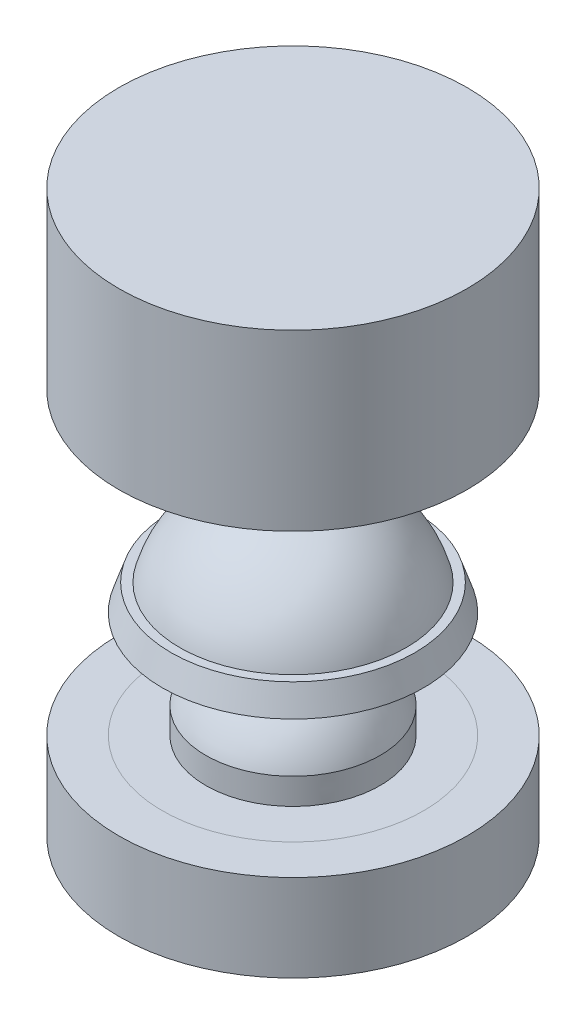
ISO-10303-21;
HEADER;
FILE_DESCRIPTION(('STEP AP214'),'2;1');
FILE_NAME('part.step','',(''),(''),'','','');
FILE_SCHEMA(('AUTOMOTIVE_DESIGN { 1 0 10303 214 1 1 1 1 }'));
ENDSEC;
DATA;
#1=APPLICATION_CONTEXT('core data for automotive mechanical design processes');
#2=APPLICATION_PROTOCOL_DEFINITION('international standard','automotive_design',2000,#1);
#3=PRODUCT_CONTEXT('',#1,'mechanical');
#4=PRODUCT('Part','Part','',(#3));
#5=PRODUCT_RELATED_PRODUCT_CATEGORY('part','',(#4));
#6=PRODUCT_DEFINITION_FORMATION('','',#4);
#7=PRODUCT_DEFINITION_CONTEXT('part definition',#1,'design');
#8=PRODUCT_DEFINITION('design','',#6,#7);
#9=PRODUCT_DEFINITION_SHAPE('','',#8);
#10=(LENGTH_UNIT() NAMED_UNIT(*) SI_UNIT(.MILLI.,.METRE.));
#11=(NAMED_UNIT(*) PLANE_ANGLE_UNIT() SI_UNIT($,.RADIAN.));
#12=(NAMED_UNIT(*) SI_UNIT($,.STERADIAN.) SOLID_ANGLE_UNIT());
#13=UNCERTAINTY_MEASURE_WITH_UNIT(LENGTH_MEASURE(1.E-05),#10,'distance_accuracy_value','');
#14=(GEOMETRIC_REPRESENTATION_CONTEXT(3) GLOBAL_UNCERTAINTY_ASSIGNED_CONTEXT((#13)) GLOBAL_UNIT_ASSIGNED_CONTEXT((#10,
#11,#12)) REPRESENTATION_CONTEXT('',''));
#15=CARTESIAN_POINT('',(0.,0.,0.));
#16=DIRECTION('',(0.,0.,1.));
#17=DIRECTION('',(1.,0.,0.));
#18=AXIS2_PLACEMENT_3D('',#15,#16,#17);
#19=CARTESIAN_POINT('',(14.8278025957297,-22.208846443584,0.));
#20=DIRECTION('',(0.,-1.,0.));
#21=DIRECTION('',(0.,0.,-1.));
#22=AXIS2_PLACEMENT_3D('',#19,#20,#21);
#23=PLANE('',#22);
#24=CARTESIAN_POINT('',(4.8278025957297,-22.208846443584,0.));
#25=DIRECTION('',(0.,-1.,0.));
#26=DIRECTION('',(0.,0.,-1.));
#27=AXIS2_PLACEMENT_3D('',#24,#25,#26);
#28=CIRCLE('',#27,15.);
#29=CARTESIAN_POINT('',(4.8278025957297,-22.208846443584,-15.));
#30=VERTEX_POINT('',#29);
#31=EDGE_CURVE('E90',#30,#30,#28,.T.);
#32=ORIENTED_EDGE('',*,*,#31,.T.);
#33=EDGE_LOOP('',(#32));
#34=FACE_BOUND('',#33,.T.);
#35=CARTESIAN_POINT('',(4.8278025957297,-22.208846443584,0.));
#36=DIRECTION('',(0.,-1.,0.));
#37=DIRECTION('',(0.,0.,-1.));
#38=AXIS2_PLACEMENT_3D('',#35,#36,#37);
#39=CIRCLE('',#38,10.);
#40=CARTESIAN_POINT('',(4.8278025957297,-22.208846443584,-10.));
#41=VERTEX_POINT('',#40);
#42=EDGE_CURVE('E12',#41,#41,#39,.T.);
#43=ORIENTED_EDGE('',*,*,#42,.F.);
#44=EDGE_LOOP('',(#43));
#45=FACE_BOUND('',#44,.T.);
#46=ADVANCED_FACE('F71',(#34,#45),#23,.T.);
#47=CARTESIAN_POINT('',(4.8278025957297,-19.208846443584,0.));
#48=DIRECTION('',(0.,1.,0.));
#49=DIRECTION('',(0.,0.,1.));
#50=AXIS2_PLACEMENT_3D('',#47,#48,#49);
#51=CONICAL_SURFACE('',#50,10.0016948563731,0.000564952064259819);
#52=ORIENTED_EDGE('',*,*,#42,.T.);
#53=EDGE_LOOP('',(#52));
#54=FACE_BOUND('',#53,.T.);
#55=CARTESIAN_POINT('',(4.8278025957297,-19.208846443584,0.));
#56=DIRECTION('',(0.,-1.,0.));
#57=DIRECTION('',(0.,0.,-1.));
#58=AXIS2_PLACEMENT_3D('',#55,#56,#57);
#59=CIRCLE('',#58,10.0016948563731);
#60=CARTESIAN_POINT('',(4.8278025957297,-19.208846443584,-10.0016948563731));
#61=VERTEX_POINT('',#60);
#62=EDGE_CURVE('E77',#61,#61,#59,.T.);
#63=ORIENTED_EDGE('',*,*,#62,.F.);
#64=EDGE_LOOP('',(#63));
#65=FACE_BOUND('',#64,.T.);
#66=ADVANCED_FACE('F110',(#54,#65),#51,.F.);
#67=CARTESIAN_POINT('',(4.8278025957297,-22.658846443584,0.));
#68=DIRECTION('',(0.,-1.,0.));
#69=DIRECTION('',(-1.,0.,0.));
#70=AXIS2_PLACEMENT_3D('',#67,#68,#69);
#71=SPHERICAL_SURFACE('',#70,10.58);
#72=ORIENTED_EDGE('',*,*,#62,.T.);
#73=EDGE_LOOP('',(#72));
#74=FACE_BOUND('',#73,.T.);
#75=ADVANCED_FACE('F113',(#74),#71,.F.);
#76=CARTESIAN_POINT('',(4.8278025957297,-22.658846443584,0.));
#77=DIRECTION('',(0.,-1.,0.));
#78=DIRECTION('',(1.,0.,0.));
#79=AXIS2_PLACEMENT_3D('',#76,#77,#78);
#80=SPHERICAL_SURFACE('',#79,13.45);
#81=CARTESIAN_POINT('',(4.8278025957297,-19.208846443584,0.));
#82=DIRECTION('',(0.,-1.,0.));
#83=DIRECTION('',(0.,0.,-1.));
#84=AXIS2_PLACEMENT_3D('',#81,#82,#83);
#85=CIRCLE('',#84,13.);
#86=CARTESIAN_POINT('',(4.8278025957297,-19.208846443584,-13.));
#87=VERTEX_POINT('',#86);
#88=EDGE_CURVE('E81',#87,#87,#85,.T.);
#89=ORIENTED_EDGE('',*,*,#88,.F.);
#90=EDGE_LOOP('',(#89));
#91=FACE_BOUND('',#90,.T.);
#92=ADVANCED_FACE('F106',(#91),#80,.T.);
#93=CARTESIAN_POINT('',(18.8278025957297,-19.208846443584,0.));
#94=DIRECTION('',(0.,1.,0.));
#95=DIRECTION('',(0.,0.,1.));
#96=AXIS2_PLACEMENT_3D('',#93,#94,#95);
#97=PLANE('',#96);
#98=ORIENTED_EDGE('',*,*,#88,.T.);
#99=EDGE_LOOP('',(#98));
#100=FACE_BOUND('',#99,.T.);
#101=CARTESIAN_POINT('',(4.8278025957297,-19.208846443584,0.));
#102=DIRECTION('',(0.,-1.,0.));
#103=DIRECTION('',(0.,0.,-1.));
#104=AXIS2_PLACEMENT_3D('',#101,#102,#103);
#105=CIRCLE('',#104,14.);
#106=CARTESIAN_POINT('',(4.8278025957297,-19.208846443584,-14.));
#107=VERTEX_POINT('',#106);
#108=EDGE_CURVE('E85',#107,#107,#105,.T.);
#109=ORIENTED_EDGE('',*,*,#108,.F.);
#110=EDGE_LOOP('',(#109));
#111=FACE_BOUND('',#110,.T.);
#112=ADVANCED_FACE('F101',(#100,#111),#97,.T.);
#113=CARTESIAN_POINT('',(4.8278025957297,-22.208846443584,0.));
#114=DIRECTION('',(0.,-1.,0.));
#115=DIRECTION('',(0.,0.,-1.));
#116=AXIS2_PLACEMENT_3D('',#113,#114,#115);
#117=CONICAL_SURFACE('',#116,15.,0.321750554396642);
#118=ORIENTED_EDGE('',*,*,#108,.T.);
#119=EDGE_LOOP('',(#118));
#120=FACE_BOUND('',#119,.T.);
#121=ORIENTED_EDGE('',*,*,#31,.F.);
#122=EDGE_LOOP('',(#121));
#123=FACE_BOUND('',#122,.T.);
#124=ADVANCED_FACE('F99',(#120,#123),#117,.T.);
#125=CLOSED_SHELL('',(#46,#66,#75,#92,#112,#124));
#126=MANIFOLD_SOLID_BREP('B2',#125);
#127=CARTESIAN_POINT('',(4.8278025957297,-44.4320712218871,0.));
#128=DIRECTION('',(0.,1.,0.));
#129=DIRECTION('',(0.,0.,1.));
#130=AXIS2_PLACEMENT_3D('',#127,#128,#129);
#131=PLANE('',#130);
#132=CARTESIAN_POINT('',(4.8278025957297,-44.4320712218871,0.));
#133=DIRECTION('',(0.,1.,0.));
#134=DIRECTION('',(0.,0.,1.));
#135=AXIS2_PLACEMENT_3D('',#132,#133,#134);
#136=CIRCLE('',#135,20.);
#137=CARTESIAN_POINT('',(4.8278025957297,-44.4320712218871,20.));
#138=VERTEX_POINT('',#137);
#139=EDGE_CURVE('E232',#138,#138,#136,.T.);
#140=ORIENTED_EDGE('',*,*,#139,.F.);
#141=EDGE_LOOP('',(#140));
#142=FACE_BOUND('',#141,.T.);
#143=ADVANCED_FACE('F198',(#142),#131,.F.);
#144=CARTESIAN_POINT('',(4.8278025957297,-44.4320712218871,0.));
#145=DIRECTION('',(0.,1.,0.));
#146=DIRECTION('',(0.,0.,1.));
#147=AXIS2_PLACEMENT_3D('',#144,#145,#146);
#148=CYLINDRICAL_SURFACE('',#147,20.);
#149=ORIENTED_EDGE('',*,*,#139,.T.);
#150=EDGE_LOOP('',(#149));
#151=FACE_BOUND('',#150,.T.);
#152=CARTESIAN_POINT('',(4.8278025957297,-34.4320712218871,0.));
#153=DIRECTION('',(0.,1.,0.));
#154=DIRECTION('',(0.,0.,1.));
#155=AXIS2_PLACEMENT_3D('',#152,#153,#154);
#156=CIRCLE('',#155,20.);
#157=CARTESIAN_POINT('',(4.8278025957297,-34.4320712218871,20.));
#158=VERTEX_POINT('',#157);
#159=EDGE_CURVE('E202',#158,#158,#156,.F.);
#160=ORIENTED_EDGE('',*,*,#159,.T.);
#161=EDGE_LOOP('',(#160));
#162=FACE_BOUND('',#161,.T.);
#163=ADVANCED_FACE('F200',(#151,#162),#148,.T.);
#164=CARTESIAN_POINT('',(4.8278025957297,-34.8820712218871,0.));
#165=DIRECTION('',(0.,-1.,0.));
#166=DIRECTION('',(-1.,0.,0.));
#167=AXIS2_PLACEMENT_3D('',#164,#165,#166);
#168=SPHERICAL_SURFACE('',#167,10.58);
#169=CARTESIAN_POINT('',(4.8278025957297,-31.4320712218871,0.));
#170=DIRECTION('',(0.,-1.,0.));
#171=DIRECTION('',(0.,0.,-1.));
#172=AXIS2_PLACEMENT_3D('',#169,#170,#171);
#173=CIRCLE('',#172,10.0016948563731);
#174=CARTESIAN_POINT('',(4.8278025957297,-31.4320712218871,-10.0016948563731));
#175=VERTEX_POINT('',#174);
#176=EDGE_CURVE('E234',#175,#175,#173,.T.);
#177=ORIENTED_EDGE('',*,*,#176,.F.);
#178=EDGE_LOOP('',(#177));
#179=FACE_BOUND('',#178,.T.);
#180=ADVANCED_FACE('F228',(#179),#168,.T.);
#181=CARTESIAN_POINT('',(4.8278025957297,-31.4320712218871,0.));
#182=DIRECTION('',(0.,1.,0.));
#183=DIRECTION('',(0.,0.,1.));
#184=AXIS2_PLACEMENT_3D('',#181,#182,#183);
#185=CONICAL_SURFACE('',#184,10.0016948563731,0.000564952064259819);
#186=CARTESIAN_POINT('',(4.8278025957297,-34.4320712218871,0.));
#187=DIRECTION('',(0.,-1.,0.));
#188=DIRECTION('',(0.,0.,-1.));
#189=AXIS2_PLACEMENT_3D('',#186,#187,#188);
#190=CIRCLE('',#189,10.);
#191=CARTESIAN_POINT('',(4.8278025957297,-34.4320712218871,-10.));
#192=VERTEX_POINT('',#191);
#193=EDGE_CURVE('E207',#192,#192,#190,.T.);
#194=ORIENTED_EDGE('',*,*,#193,.F.);
#195=EDGE_LOOP('',(#194));
#196=FACE_BOUND('',#195,.T.);
#197=ORIENTED_EDGE('',*,*,#176,.T.);
#198=EDGE_LOOP('',(#197));
#199=FACE_BOUND('',#198,.T.);
#200=ADVANCED_FACE('F220',(#196,#199),#185,.T.);
#201=CARTESIAN_POINT('',(14.8278025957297,-34.4320712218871,0.));
#202=DIRECTION('',(0.,-1.,0.));
#203=DIRECTION('',(0.,0.,-1.));
#204=AXIS2_PLACEMENT_3D('',#201,#202,#203);
#205=PLANE('',#204);
#206=CARTESIAN_POINT('',(4.8278025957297,-34.4320712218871,-15.));
#207=CARTESIAN_POINT('',(5.07532465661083,-34.4320712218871,-15.0000190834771));
#208=CARTESIAN_POINT('',(5.32285951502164,-34.4320712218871,-14.9941059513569));
#209=CARTESIAN_POINT('',(5.81556402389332,-34.4320712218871,-14.9702985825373));
#210=CARTESIAN_POINT('',(6.06073787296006,-34.4320712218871,-14.9524909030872));
#211=CARTESIAN_POINT('',(6.54872354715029,-34.4320712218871,-14.9048990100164));
#212=CARTESIAN_POINT('',(6.79154106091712,-34.4320712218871,-14.8751733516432));
#213=CARTESIAN_POINT('',(7.27481111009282,-34.4320712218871,-14.8037804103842));
#214=CARTESIAN_POINT('',(7.51526796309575,-34.4320712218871,-14.7621423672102));
#215=CARTESIAN_POINT('',(7.99381910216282,-34.4320712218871,-14.6669527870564));
#216=CARTESIAN_POINT('',(8.23191332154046,-34.4320712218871,-14.6134009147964));
#217=CARTESIAN_POINT('',(8.70574394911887,-34.4320712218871,-14.4944140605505));
#218=CARTESIAN_POINT('',(8.94147298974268,-34.4320712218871,-14.4289497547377));
#219=CARTESIAN_POINT('',(9.41058131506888,-34.4320712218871,-14.286166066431));
#220=CARTESIAN_POINT('',(9.64394327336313,-34.4320712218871,-14.2087897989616));
#221=CARTESIAN_POINT('',(10.1083271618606,-34.4320712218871,-14.042212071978));
#222=CARTESIAN_POINT('',(10.3393195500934,-34.4320712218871,-13.9529283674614));
#223=CARTESIAN_POINT('',(10.7967237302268,-34.4320712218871,-13.7634844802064));
#224=CARTESIAN_POINT('',(11.0231368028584,-34.4320712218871,-13.6633273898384));
#225=CARTESIAN_POINT('',(11.4691967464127,-34.4320712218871,-13.4528238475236));
#226=CARTESIAN_POINT('',(11.6888805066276,-34.4320712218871,-13.3425556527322));
#227=CARTESIAN_POINT('',(12.121487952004,-34.4320712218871,-13.1118590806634));
#228=CARTESIAN_POINT('',(12.3344391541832,-34.4320712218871,-12.9914823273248));
#229=CARTESIAN_POINT('',(12.7535917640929,-34.4320712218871,-12.7405951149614));
#230=CARTESIAN_POINT('',(12.9598081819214,-34.4320712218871,-12.6101097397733));
#231=CARTESIAN_POINT('',(13.3655043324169,-34.4320712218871,-12.3390321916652));
#232=CARTESIAN_POINT('',(13.5649836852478,-34.4320712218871,-12.1984394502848));
#233=CARTESIAN_POINT('',(13.9572217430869,-34.4320712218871,-11.90717295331));
#234=CARTESIAN_POINT('',(14.1499622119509,-34.4320712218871,-11.7564746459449));
#235=CARTESIAN_POINT('',(14.5287406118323,-34.4320712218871,-11.4450198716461));
#236=CARTESIAN_POINT('',(14.7147405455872,-34.4320712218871,-11.2842172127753));
#237=CARTESIAN_POINT('',(15.0800586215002,-34.4320712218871,-10.9525778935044));
#238=CARTESIAN_POINT('',(15.2593177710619,-34.4320712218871,-10.7816763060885));
#239=CARTESIAN_POINT('',(15.6094238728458,-34.4320712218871,-10.4315941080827));
#240=CARTESIAN_POINT('',(15.7802740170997,-34.4320712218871,-10.2524166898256));
#241=CARTESIAN_POINT('',(16.1118235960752,-34.4320712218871,-9.88723717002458));
#242=CARTESIAN_POINT('',(16.2725870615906,-34.4320712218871,-9.70129325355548));
#243=CARTESIAN_POINT('',(16.5839804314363,-34.4320712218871,-9.32260567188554));
#244=CARTESIAN_POINT('',(16.7346555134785,-34.4320712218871,-9.12989917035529));
#245=CARTESIAN_POINT('',(17.0258916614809,-34.4320712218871,-8.73770686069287));
#246=CARTESIAN_POINT('',(17.1664761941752,-34.4320712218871,-8.53823848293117));
#247=CARTESIAN_POINT('',(17.4375536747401,-34.4320712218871,-8.13254228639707));
#248=CARTESIAN_POINT('',(17.5680460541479,-34.4320712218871,-7.92631408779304));
#249=CARTESIAN_POINT('',(17.8189639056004,-34.4320712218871,-7.50711592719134));
#250=CARTESIAN_POINT('',(17.9393631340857,-34.4320712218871,-7.29413026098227));
#251=CARTESIAN_POINT('',(18.1701201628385,-34.4320712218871,-6.86143135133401));
#252=CARTESIAN_POINT('',(18.2804251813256,-34.4320712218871,-6.64168997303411));
#253=CARTESIAN_POINT('',(18.4910222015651,-34.4320712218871,-6.19549401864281));
#254=CARTESIAN_POINT('',(18.5912348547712,-34.4320712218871,-5.96900203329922));
#255=CARTESIAN_POINT('',(18.7807200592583,-34.4320712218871,-5.51158845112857));
#256=CARTESIAN_POINT('',(18.869996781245,-34.4320712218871,-5.28066858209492));
#257=CARTESIAN_POINT('',(19.0365604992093,-34.4320712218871,-4.81640816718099));
#258=CARTESIAN_POINT('',(19.113928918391,-34.4320712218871,-4.58309687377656));
#259=CARTESIAN_POINT('',(19.2567014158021,-34.4320712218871,-4.11407008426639));
#260=CARTESIAN_POINT('',(19.3221614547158,-34.4320712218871,-3.87837163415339));
#261=CARTESIAN_POINT('',(19.4411430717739,-34.4320712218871,-3.40458193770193));
#262=CARTESIAN_POINT('',(19.4946930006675,-34.4320712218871,-3.16649781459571));
#263=CARTESIAN_POINT('',(19.589882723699,-34.4320712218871,-2.68794654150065));
#264=CARTESIAN_POINT('',(19.6315218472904,-34.4320712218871,-2.44747925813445));
#265=CARTESIAN_POINT('',(19.7029195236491,-34.4320712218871,-1.9641685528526));
#266=CARTESIAN_POINT('',(19.7326478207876,-34.4320712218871,-1.72132066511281));
#267=CARTESIAN_POINT('',(19.7802528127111,-34.4320712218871,-1.23325210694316));
#268=CARTESIAN_POINT('',(19.7980699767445,-34.4320712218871,-0.988025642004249));
#269=CARTESIAN_POINT('',(19.8218844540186,-34.4320712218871,-0.495202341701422));
#270=CARTESIAN_POINT('',(19.8277941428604,-34.4320712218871,-0.247601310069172));
#271=CARTESIAN_POINT('',(19.8278110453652,-34.4320712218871,0.247506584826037));
#272=CARTESIAN_POINT('',(19.8219227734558,-34.4320712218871,0.495013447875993));
#273=CARTESIAN_POINT('',(19.7981428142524,-34.4320712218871,0.98767531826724));
#274=CARTESIAN_POINT('',(19.7803375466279,-34.4320712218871,1.23283445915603));
#275=CARTESIAN_POINT('',(19.7327533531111,-34.4320712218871,1.72079537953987));
#276=CARTESIAN_POINT('',(19.7030326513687,-34.4320712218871,1.96360282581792));
#277=CARTESIAN_POINT('',(19.6316458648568,-34.4320712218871,2.44685972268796));
#278=CARTESIAN_POINT('',(19.5900086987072,-34.4320712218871,2.68731344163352));
#279=CARTESIAN_POINT('',(19.4948188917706,-34.4320712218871,3.16586469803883));
#280=CARTESIAN_POINT('',(19.4412655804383,-34.4320712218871,3.40396210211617));
#281=CARTESIAN_POINT('',(19.3222734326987,-34.4320712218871,3.87780567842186));
#282=CARTESIAN_POINT('',(19.2568049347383,-34.4320712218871,4.11354439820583));
#283=CARTESIAN_POINT('',(19.1140104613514,-34.4320712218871,4.58267859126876));
#284=CARTESIAN_POINT('',(19.0366272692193,-34.4320712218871,4.81605663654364));
#285=CARTESIAN_POINT('',(18.8700336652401,-34.4320712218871,5.28047940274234));
#286=CARTESIAN_POINT('',(18.7807406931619,-34.4320712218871,5.51149446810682));
#287=CARTESIAN_POINT('',(18.5912867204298,-34.4320712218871,5.96892098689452));
#288=CARTESIAN_POINT('',(18.4911298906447,-34.4320712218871,6.19533416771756));
#289=CARTESIAN_POINT('',(18.2806265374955,-34.4320712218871,6.64139418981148));
#290=CARTESIAN_POINT('',(18.1703582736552,-34.4320712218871,6.86107792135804));
#291=CARTESIAN_POINT('',(17.9396616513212,-34.4320712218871,7.29368534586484));
#292=CARTESIAN_POINT('',(17.8192849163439,-34.4320712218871,7.50663655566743));
#293=CARTESIAN_POINT('',(17.5683977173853,-34.4320712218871,7.92578917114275));
#294=CARTESIAN_POINT('',(17.4379123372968,-34.4320712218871,8.13200558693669));
#295=CARTESIAN_POINT('',(17.1668347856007,-34.4320712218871,8.53770173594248));
#296=CARTESIAN_POINT('',(17.026242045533,-34.4320712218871,8.7371810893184));
#297=CARTESIAN_POINT('',(16.7349755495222,-34.4320712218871,9.12941914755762));
#298=CARTESIAN_POINT('',(16.5842772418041,-34.4320712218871,9.32215961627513));
#299=CARTESIAN_POINT('',(16.2728224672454,-34.4320712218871,9.70093801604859));
#300=CARTESIAN_POINT('',(16.1120198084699,-34.4320712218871,9.88693794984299));
#301=CARTESIAN_POINT('',(15.7803804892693,-34.4320712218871,10.2522560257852));
#302=CARTESIAN_POINT('',(15.6094789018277,-34.4320712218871,10.4315151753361));
#303=CARTESIAN_POINT('',(15.2593967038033,-34.4320712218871,10.7816212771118));
#304=CARTESIAN_POINT('',(15.0802192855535,-34.4320712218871,10.9524714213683));
#305=CARTESIAN_POINT('',(14.7150397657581,-34.4320712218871,11.2840210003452));
#306=CARTESIAN_POINT('',(14.5290958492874,-34.4320712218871,11.4447844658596));
#307=CARTESIAN_POINT('',(14.1504082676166,-34.4320712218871,11.7561778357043));
#308=CARTESIAN_POINT('',(13.957701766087,-34.4320712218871,11.9068529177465));
#309=CARTESIAN_POINT('',(13.5655094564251,-34.4320712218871,12.1980890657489));
#310=CARTESIAN_POINT('',(13.3660410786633,-34.4320712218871,12.3386735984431));
#311=CARTESIAN_POINT('',(12.9603448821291,-34.4320712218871,12.609751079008));
#312=CARTESIAN_POINT('',(12.7541166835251,-34.4320712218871,12.7402434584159));
#313=CARTESIAN_POINT('',(12.3349185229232,-34.4320712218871,12.9911613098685));
#314=CARTESIAN_POINT('',(12.121932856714,-34.4320712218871,13.111560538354));
#315=CARTESIAN_POINT('',(11.6892339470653,-34.4320712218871,13.3423175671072));
#316=CARTESIAN_POINT('',(11.4694925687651,-34.4320712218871,13.4526225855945));
#317=CARTESIAN_POINT('',(11.0232966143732,-34.4320712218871,13.6632196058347));
#318=CARTESIAN_POINT('',(10.7968046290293,-34.4320712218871,13.7634322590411));
#319=CARTESIAN_POINT('',(10.3393910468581,-34.4320712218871,13.9529174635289));
#320=CARTESIAN_POINT('',(10.1084711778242,-34.4320712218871,14.0421941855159));
#321=CARTESIAN_POINT('',(9.64421076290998,-34.4320712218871,14.2087579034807));
#322=CARTESIAN_POINT('',(9.41089946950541,-34.4320712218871,14.2861263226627));
#323=CARTESIAN_POINT('',(8.94187267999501,-34.4320712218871,14.4288988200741));
#324=CARTESIAN_POINT('',(8.70617422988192,-34.4320712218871,14.4943588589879));
#325=CARTESIAN_POINT('',(8.23238453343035,-34.4320712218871,14.6133404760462));
#326=CARTESIAN_POINT('',(7.9943004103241,-34.4320712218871,14.6668904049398));
#327=CARTESIAN_POINT('',(7.51574913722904,-34.4320712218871,14.7620801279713));
#328=CARTESIAN_POINT('',(7.27528185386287,-34.4320712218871,14.8037192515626));
#329=CARTESIAN_POINT('',(6.79197114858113,-34.4320712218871,14.8751169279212));
#330=CARTESIAN_POINT('',(6.54912326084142,-34.4320712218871,14.9048452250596));
#331=CARTESIAN_POINT('',(6.06105470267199,-34.4320712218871,14.9524502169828));
#332=CARTESIAN_POINT('',(5.81582823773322,-34.4320712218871,14.9702673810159));
#333=CARTESIAN_POINT('',(5.32300493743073,-34.4320712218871,14.9940818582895));
#334=CARTESIAN_POINT('',(5.07540390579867,-34.4320712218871,14.999991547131));
#335=CARTESIAN_POINT('',(4.58029601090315,-34.4320712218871,15.0000084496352));
#336=CARTESIAN_POINT('',(4.33278914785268,-34.4320712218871,14.9941201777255));
#337=CARTESIAN_POINT('',(3.84012727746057,-34.4320712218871,14.9703402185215));
#338=CARTESIAN_POINT('',(3.59496813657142,-34.4320712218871,14.9525349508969));
#339=CARTESIAN_POINT('',(3.10700721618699,-34.4320712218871,14.9049507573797));
#340=CARTESIAN_POINT('',(2.86419976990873,-34.4320712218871,14.8752300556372));
#341=CARTESIAN_POINT('',(2.3809428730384,-34.4320712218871,14.8038432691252));
#342=CARTESIAN_POINT('',(2.14048915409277,-34.4320712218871,14.7622061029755));
#343=CARTESIAN_POINT('',(1.66193789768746,-34.4320712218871,14.667016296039));
#344=CARTESIAN_POINT('',(1.42384049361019,-34.4320712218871,14.6134629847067));
#345=CARTESIAN_POINT('',(0.949996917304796,-34.4320712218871,14.4944708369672));
#346=CARTESIAN_POINT('',(0.714258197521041,-34.4320712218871,14.4290023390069));
#347=CARTESIAN_POINT('',(0.2451240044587,-34.4320712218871,14.2862078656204));
#348=CARTESIAN_POINT('',(0.0117459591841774,-34.4320712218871,14.2088246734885));
#349=CARTESIAN_POINT('',(-0.452676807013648,-34.4320712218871,14.0422310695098));
#350=CARTESIAN_POINT('',(-0.68369187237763,-34.4320712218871,13.9529380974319));
#351=CARTESIAN_POINT('',(-1.14111839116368,-34.4320712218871,13.7634841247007));
#352=CARTESIAN_POINT('',(-1.36753157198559,-34.4320712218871,13.6633272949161));
#353=CARTESIAN_POINT('',(-1.81359159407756,-34.4320712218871,13.4528239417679));
#354=CARTESIAN_POINT('',(-2.03327532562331,-34.4320712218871,13.342555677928));
#355=CARTESIAN_POINT('',(-2.46588275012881,-34.4320712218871,13.1118590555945));
#356=CARTESIAN_POINT('',(-2.67883395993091,-34.4320712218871,12.9914823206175));
#357=CARTESIAN_POINT('',(-3.09798657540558,-34.4320712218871,12.7405951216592));
#358=CARTESIAN_POINT('',(-3.30420299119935,-34.4320712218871,12.6101097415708));
#359=CARTESIAN_POINT('',(-3.70989914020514,-34.4320712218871,12.3390321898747));
#360=CARTESIAN_POINT('',(-3.90937849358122,-34.4320712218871,12.1984394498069));
#361=CARTESIAN_POINT('',(-4.30161655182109,-34.4320712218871,11.9071729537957));
#362=CARTESIAN_POINT('',(-4.49435702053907,-34.4320712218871,11.7564746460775));
#363=CARTESIAN_POINT('',(-4.87313542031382,-34.4320712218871,11.4450198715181));
#364=CARTESIAN_POINT('',(-5.05913535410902,-34.4320712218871,11.2842172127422));
#365=CARTESIAN_POINT('',(-5.42445343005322,-34.4320712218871,10.9525778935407));
#366=CARTESIAN_POINT('',(-5.6037125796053,-34.4320712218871,10.7816763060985));
#367=CARTESIAN_POINT('',(-5.9538186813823,-34.4320712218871,10.431594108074));
#368=CARTESIAN_POINT('',(-6.12466882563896,-34.4320712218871,10.2524166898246));
#369=CARTESIAN_POINT('',(-6.45621840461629,-34.4320712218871,9.88723717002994));
#370=CARTESIAN_POINT('',(-6.6169818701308,-34.4320712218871,9.70129325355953));
#371=CARTESIAN_POINT('',(-6.92837523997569,-34.4320712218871,9.32260567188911));
#372=CARTESIAN_POINT('',(-7.079050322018,-34.4320712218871,9.12989917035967));
#373=CARTESIAN_POINT('',(-7.37028647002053,-34.4320712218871,8.73770686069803));
#374=CARTESIAN_POINT('',(-7.51087100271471,-34.4320712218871,8.5382384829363));
#375=CARTESIAN_POINT('',(-7.7819484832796,-34.4320712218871,8.13254228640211));
#376=CARTESIAN_POINT('',(-7.91244086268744,-34.4320712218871,7.926314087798));
#377=CARTESIAN_POINT('',(-8.16335871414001,-34.4320712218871,7.5071159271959));
#378=CARTESIAN_POINT('',(-8.28375794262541,-34.4320712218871,7.29413026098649));
#379=CARTESIAN_POINT('',(-8.51451497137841,-34.4320712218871,6.86143135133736));
#380=CARTESIAN_POINT('',(-8.62481998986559,-34.4320712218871,6.64168997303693));
#381=CARTESIAN_POINT('',(-8.83541701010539,-34.4320712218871,6.19549401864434));
#382=CARTESIAN_POINT('',(-8.93562966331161,-34.4320712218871,5.96900203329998));
#383=CARTESIAN_POINT('',(-9.12511486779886,-34.4320712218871,5.51158845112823));
#384=CARTESIAN_POINT('',(-9.21439158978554,-34.4320712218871,5.28066858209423));
#385=CARTESIAN_POINT('',(-9.3809553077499,-34.4320712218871,4.81640816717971));
#386=CARTESIAN_POINT('',(-9.45832372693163,-34.4320712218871,4.58309687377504));
#387=CARTESIAN_POINT('',(-9.6010962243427,-34.4320712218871,4.11407008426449));
#388=CARTESIAN_POINT('',(-9.66655626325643,-34.4320712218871,3.87837163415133));
#389=CARTESIAN_POINT('',(-9.78553788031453,-34.4320712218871,3.40458193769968));
#390=CARTESIAN_POINT('',(-9.83908780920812,-34.4320712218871,3.16649781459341));
#391=CARTESIAN_POINT('',(-9.93427753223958,-34.4320712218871,2.68794654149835));
#392=CARTESIAN_POINT('',(-9.97591665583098,-34.4320712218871,2.4474792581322));
#393=CARTESIAN_POINT('',(-10.0473143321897,-34.4320712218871,1.96416855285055));
#394=CARTESIAN_POINT('',(-10.0770426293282,-34.4320712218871,1.72132066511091));
#395=CARTESIAN_POINT('',(-10.1246476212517,-34.4320712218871,1.23325210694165));
#396=CARTESIAN_POINT('',(-10.1424647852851,-34.4320712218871,0.988025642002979));
#397=CARTESIAN_POINT('',(-10.1662792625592,-34.4320712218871,0.495202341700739));
#398=CARTESIAN_POINT('',(-10.172188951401,-34.4320712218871,0.247601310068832));
#399=CARTESIAN_POINT('',(-10.1722058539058,-34.4320712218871,-0.247506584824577));
#400=CARTESIAN_POINT('',(-10.1663175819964,-34.4320712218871,-0.495013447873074));
#401=CARTESIAN_POINT('',(-10.142537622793,-34.4320712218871,-0.987675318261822));
#402=CARTESIAN_POINT('',(-10.1247323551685,-34.4320712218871,-1.23283445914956));
#403=CARTESIAN_POINT('',(-10.0771481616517,-34.4320712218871,-1.72079537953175));
#404=CARTESIAN_POINT('',(-10.0474274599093,-34.4320712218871,-1.96360282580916));
#405=CARTESIAN_POINT('',(-9.97604067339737,-34.4320712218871,-2.44685972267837));
#406=CARTESIAN_POINT('',(-9.93440350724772,-34.4320712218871,-2.68731344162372));
#407=CARTESIAN_POINT('',(-9.83921370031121,-34.4320712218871,-3.16586469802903));
#408=CARTESIAN_POINT('',(-9.78566038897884,-34.4320712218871,-3.40396210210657));
#409=CARTESIAN_POINT('',(-9.66666824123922,-34.4320712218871,-3.87780567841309));
#410=CARTESIAN_POINT('',(-9.6011997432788,-34.4320712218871,-4.11354439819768));
#411=CARTESIAN_POINT('',(-9.45840526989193,-34.4320712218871,-4.58267859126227));
#412=CARTESIAN_POINT('',(-9.38102207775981,-34.4320712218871,-4.81605663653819));
#413=CARTESIAN_POINT('',(-9.21442847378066,-34.4320712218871,-5.2804794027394));
#414=CARTESIAN_POINT('',(-9.12513550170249,-34.4320712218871,-5.51149446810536));
#415=CARTESIAN_POINT('',(-8.93568152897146,-34.4320712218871,-5.96892098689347));
#416=CARTESIAN_POINT('',(-8.83552469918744,-34.4320712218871,-6.19533416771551));
#417=CARTESIAN_POINT('',(-8.62502134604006,-34.4320712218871,-6.64139418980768));
#418=CARTESIAN_POINT('',(-8.51475308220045,-34.4320712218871,-6.8610779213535));
#419=CARTESIAN_POINT('',(-8.28405645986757,-34.4320712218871,-7.29368534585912));
#420=CARTESIAN_POINT('',(-8.16367972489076,-34.4320712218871,-7.50663655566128));
#421=CARTESIAN_POINT('',(-7.91279252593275,-34.4320712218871,-7.92578917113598));
#422=CARTESIAN_POINT('',(-7.78230714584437,-34.4320712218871,-8.13200558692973));
#423=CARTESIAN_POINT('',(-7.51122959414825,-34.4320712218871,-8.53770173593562));
#424=CARTESIAN_POINT('',(-7.37063685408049,-34.4320712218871,-8.73718108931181));
#425=CARTESIAN_POINT('',(-7.07937035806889,-34.4320712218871,-9.12941914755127));
#426=CARTESIAN_POINT('',(-6.92867205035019,-34.4320712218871,-9.32215961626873));
#427=CARTESIAN_POINT('',(-6.61721727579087,-34.4320712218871,-9.7009380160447));
#428=CARTESIAN_POINT('',(-6.4564146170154,-34.4320712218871,-9.88693794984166));
#429=CARTESIAN_POINT('',(-6.12477529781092,-34.4320712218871,-10.2522560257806));
#430=CARTESIAN_POINT('',(-5.95387371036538,-34.4320712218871,-10.4315151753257));
#431=CARTESIAN_POINT('',(-5.60379151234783,-34.4320712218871,-10.7816212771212));
#432=CARTESIAN_POINT('',(-5.4246140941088,-34.4320712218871,-10.9524714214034));
#433=CARTESIAN_POINT('',(-5.05943457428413,-34.4320712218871,-11.2840210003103));
#434=CARTESIAN_POINT('',(-4.87349065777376,-34.4320712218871,-11.4447844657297));
#435=CARTESIAN_POINT('',(-4.49480307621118,-34.4320712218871,-11.7561778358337));
#436=CARTESIAN_POINT('',(-4.30209657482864,-34.4320712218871,-11.9068529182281));
#437=CARTESIAN_POINT('',(-3.9099042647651,-34.4320712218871,-12.1980890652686));
#438=CARTESIAN_POINT('',(-3.71043588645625,-34.4320712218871,-12.3386735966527));
#439=CARTESIAN_POINT('',(-3.30473969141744,-34.4320712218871,-12.6097510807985));
#440=CARTESIAN_POINT('',(-3.09851149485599,-34.4320712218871,-12.7402434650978));
#441=CARTESIAN_POINT('',(-2.67931332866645,-34.4320712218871,-12.9911613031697));
#442=CARTESIAN_POINT('',(-2.46632765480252,-34.4320712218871,-13.1115605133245));
#443=CARTESIAN_POINT('',(-2.0336287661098,-34.4320712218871,-13.3423175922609));
#444=CARTESIAN_POINT('',(-1.81388741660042,-34.4320712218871,-13.4526226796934));
#445=CARTESIAN_POINT('',(-1.36769138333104,-34.4320712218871,-13.6632195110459));
#446=CARTESIAN_POINT('',(-1.14119928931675,-34.4320712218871,-13.7634319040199));
#447=CARTESIAN_POINT('',(-0.683763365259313,-34.4320712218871,-13.9529271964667));
#448=CARTESIAN_POINT('',(-0.452820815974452,-34.4320712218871,-14.0422131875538));
#449=CARTESIAN_POINT('',(0.0114784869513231,-34.4320712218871,-14.2087927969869));
#450=CARTESIAN_POINT('',(0.244805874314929,-34.4320712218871,-14.2861681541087));
#451=CARTESIAN_POINT('',(0.713858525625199,-34.4320712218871,-14.4289514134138));
#452=CARTESIAN_POINT('',(0.949566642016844,-34.4320712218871,-14.4944156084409));
#453=CARTESIAN_POINT('',(1.42336932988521,-34.4320712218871,-14.6134026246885));
#454=CARTESIAN_POINT('',(1.66145669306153,-34.4320712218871,-14.6669541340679));
#455=CARTESIAN_POINT('',(2.14000793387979,-34.4320712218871,-14.7621436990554));
#456=CARTESIAN_POINT('',(2.38047187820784,-34.4320712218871,-14.8037814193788));
#457=CARTESIAN_POINT('',(2.86376998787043,-34.4320712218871,-14.875174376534));
#458=CARTESIAN_POINT('',(3.10660857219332,-34.4320712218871,-14.9048996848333));
#459=CARTESIAN_POINT('',(3.59465027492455,-34.4320712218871,-14.9524915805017));
#460=CARTESIAN_POINT('',(3.83985914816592,-34.4320712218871,-14.9702989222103));
#461=CARTESIAN_POINT('',(4.33264769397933,-34.4320712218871,-14.9941062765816));
#462=CARTESIAN_POINT('',(4.58023159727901,-34.4320712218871,-15.0000190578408));
#463=CARTESIAN_POINT('',(4.8278025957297,-34.4320712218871,-15.));
#464=B_SPLINE_CURVE_WITH_KNOTS('',3,(#206,#207,#208,#209,#210,#211,#212,#213,#214,#215,#216,
#217,#218,#219,#220,#221,#222,#223,#224,#225,#226,#227,#228,#229,#230,#231,#232,#233,#234,#235,
#236,#237,#238,#239,#240,#241,#242,#243,#244,#245,#246,#247,#248,#249,#250,#251,#252,#253,#254,
#255,#256,#257,#258,#259,#260,#261,#262,#263,#264,#265,#266,#267,#268,#269,#270,#271,#272,#273,
#274,#275,#276,#277,#278,#279,#280,#281,#282,#283,#284,#285,#286,#287,#288,#289,#290,#291,#292,
#293,#294,#295,#296,#297,#298,#299,#300,#301,#302,#303,#304,#305,#306,#307,#308,#309,#310,#311,
#312,#313,#314,#315,#316,#317,#318,#319,#320,#321,#322,#323,#324,#325,#326,#327,#328,#329,#330,
#331,#332,#333,#334,#335,#336,#337,#338,#339,#340,#341,#342,#343,#344,#345,#346,#347,#348,#349,
#350,#351,#352,#353,#354,#355,#356,#357,#358,#359,#360,#361,#362,#363,#364,#365,#366,#367,#368,
#369,#370,#371,#372,#373,#374,#375,#376,#377,#378,#379,#380,#381,#382,#383,#384,#385,#386,#387,
#388,#389,#390,#391,#392,#393,#394,#395,#396,#397,#398,#399,#400,#401,#402,#403,#404,#405,#406,
#407,#408,#409,#410,#411,#412,#413,#414,#415,#416,#417,#418,#419,#420,#421,#422,#423,#424,#425,
#426,#427,#428,#429,#430,#431,#432,#433,#434,#435,#436,#437,#438,#439,#440,#441,#442,#443,#444,
#445,#446,#447,#448,#449,#450,#451,#452,#453,#454,#455,#456,#457,#458,#459,#460,#461,#462,#463),
.UNSPECIFIED.,.F.,.F.,(4,2,2,2,2,2,2,2,2,2,2,2,2,2,2,2,2,2,2,2,2,2,2,2,2,2,2,2,2,2,2,2,2,2,2,2,
2,2,2,2,2,2,2,2,2,2,2,2,2,2,2,2,2,2,2,2,2,2,2,2,2,2,2,2,2,2,2,2,2,2,2,2,2,2,2,2,2,2,2,2,2,2,2,2,
2,2,2,2,2,2,2,2,2,2,2,2,2,2,2,2,2,2,2,2,2,2,2,2,2,2,2,2,2,2,2,2,2,2,2,2,2,2,2,2,2,2,2,2,4),(0.,
0.742513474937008,1.47968166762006,2.21327155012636,2.94507601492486,3.67690107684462,
4.4105525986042,5.14782302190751,5.8904785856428,6.63292349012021,7.37004184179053,
8.10360136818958,8.8353955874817,9.56723099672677,10.3009137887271,11.038236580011,
11.7809656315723,12.5234105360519,13.2605288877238,13.9940884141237,14.7258826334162,
15.4577180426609,16.1914008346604,16.9287236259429,17.6714526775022,18.4138975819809,
19.1510159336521,19.8845754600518,20.6163696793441,21.3482050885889,22.0818878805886,
22.8192106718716,23.5619397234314,24.3043846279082,25.0415029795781,25.7750625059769,
26.5068567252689,27.2386921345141,27.9723749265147,28.7096977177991,29.4524267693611,
30.1948716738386,30.931990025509,31.6655495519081,32.3973437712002,33.1291791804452,
33.8628619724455,34.6001847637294,35.3429138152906,36.0853587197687,36.8224770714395,
37.5560365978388,38.287830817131,39.019666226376,39.753349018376,40.4906718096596,
41.2334008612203,41.9758457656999,42.7129641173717,43.4465236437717,44.1783178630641,
44.9101532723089,45.6438360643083,46.3811588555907,47.1238879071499,47.8663328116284,
48.6034511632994,49.3370106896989,50.0688049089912,50.8006403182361,51.5343231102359,
52.2716459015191,53.0143749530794,53.7568198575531,54.4939382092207,55.2274977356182,
55.9592919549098,56.6911273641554,57.4248101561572,58.1621329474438,58.9048619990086,
59.6473069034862,60.3844252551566,61.1179847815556,61.8497790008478,62.5816144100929,
63.3152972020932,64.0526199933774,64.795349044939,65.5377939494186,66.2749123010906,
67.0084718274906,67.7402660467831,68.4721014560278,69.205784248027,69.9431070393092,
70.685836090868,71.4282809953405,72.1653993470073,72.8989588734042,73.6307530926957,
74.3625885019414,75.0962712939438,75.8335940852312,76.5763231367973,77.3187680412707,
78.0558863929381,78.7894459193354,79.5212401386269,80.2530755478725,80.9867583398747,
81.7240811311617,82.4668101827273,83.2092550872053,83.9463734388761,84.6799329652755,
85.4117271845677,86.1435625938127,86.8772453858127,87.6145681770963,88.357297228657,
89.0998156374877,89.8369863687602,90.5705771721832,91.3023817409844,92.0342069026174,
92.7678593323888,93.5051322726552,94.2477927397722),.UNSPECIFIED.);
#465=CARTESIAN_POINT('',(4.8278025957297,-34.4320712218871,-15.));
#466=VERTEX_POINT('',#465);
#467=EDGE_CURVE('E69',#466,#466,#464,.T.);
#468=ORIENTED_EDGE('',*,*,#467,.F.);
#469=EDGE_LOOP('',(#468));
#470=FACE_BOUND('',#469,.T.);
#471=ORIENTED_EDGE('',*,*,#193,.T.);
#472=EDGE_LOOP('',(#471));
#473=FACE_BOUND('',#472,.T.);
#474=ADVANCED_FACE('F211',(#470,#473),#205,.F.);
#475=CARTESIAN_POINT('',(4.51562772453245,-34.4320712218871,-15.0000002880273));
#476=DIRECTION('',(0.,1.,0.));
#477=DIRECTION('',(0.999999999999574,0.,9.22647382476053E-07));
#478=AXIS2_PLACEMENT_3D('',#475,#476,#477);
#479=PLANE('',#478);
#480=ORIENTED_EDGE('',*,*,#159,.F.);
#481=EDGE_LOOP('',(#480));
#482=FACE_BOUND('',#481,.T.);
#483=ORIENTED_EDGE('',*,*,#467,.T.);
#484=EDGE_LOOP('',(#483));
#485=FACE_BOUND('',#484,.T.);
#486=ADVANCED_FACE('F214',(#482,#485),#479,.T.);
#487=CLOSED_SHELL('',(#143,#163,#180,#200,#474,#486));
#488=MANIFOLD_SOLID_BREP('B7',#487);
#489=CARTESIAN_POINT('',(4.8278025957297,-10.,0.));
#490=DIRECTION('',(0.,1.,0.));
#491=DIRECTION('',(0.,0.,1.));
#492=AXIS2_PLACEMENT_3D('',#489,#490,#491);
#493=CYLINDRICAL_SURFACE('',#492,20.);
#494=CARTESIAN_POINT('',(4.8278025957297,0.,0.));
#495=DIRECTION('',(0.,1.,0.));
#496=DIRECTION('',(0.,0.,1.));
#497=AXIS2_PLACEMENT_3D('',#494,#495,#496);
#498=CIRCLE('',#497,20.);
#499=CARTESIAN_POINT('',(4.8278025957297,0.,20.));
#500=VERTEX_POINT('',#499);
#501=EDGE_CURVE('E329',#500,#500,#498,.F.);
#502=ORIENTED_EDGE('',*,*,#501,.F.);
#503=EDGE_LOOP('',(#502));
#504=FACE_BOUND('',#503,.T.);
#505=CARTESIAN_POINT('',(4.8278025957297,20.,0.));
#506=DIRECTION('',(0.,1.,0.));
#507=DIRECTION('',(0.,0.,1.));
#508=AXIS2_PLACEMENT_3D('',#505,#506,#507);
#509=CIRCLE('',#508,20.);
#510=CARTESIAN_POINT('',(4.8278025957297,20.,20.));
#511=VERTEX_POINT('',#510);
#512=EDGE_CURVE('E362',#511,#511,#509,.T.);
#513=ORIENTED_EDGE('',*,*,#512,.F.);
#514=EDGE_LOOP('',(#513));
#515=FACE_BOUND('',#514,.T.);
#516=ADVANCED_FACE('F326',(#504,#515),#493,.T.);
#517=CARTESIAN_POINT('',(4.8278025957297,20.,0.));
#518=DIRECTION('',(0.,1.,0.));
#519=DIRECTION('',(0.,0.,1.));
#520=AXIS2_PLACEMENT_3D('',#517,#518,#519);
#521=PLANE('',#520);
#522=ORIENTED_EDGE('',*,*,#512,.T.);
#523=EDGE_LOOP('',(#522));
#524=FACE_BOUND('',#523,.T.);
#525=ADVANCED_FACE('F352',(#524),#521,.T.);
#526=CARTESIAN_POINT('',(4.8278025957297,-0.450000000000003,0.));
#527=DIRECTION('',(0.,-1.,0.));
#528=DIRECTION('',(1.,0.,0.));
#529=AXIS2_PLACEMENT_3D('',#526,#527,#528);
#530=SPHERICAL_SURFACE('',#529,13.45);
#531=CARTESIAN_POINT('',(4.8278025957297,3.,0.));
#532=DIRECTION('',(0.,-1.,0.));
#533=DIRECTION('',(0.,0.,-1.));
#534=AXIS2_PLACEMENT_3D('',#531,#532,#533);
#535=CIRCLE('',#534,13.);
#536=CARTESIAN_POINT('',(4.8278025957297,3.,-13.));
#537=VERTEX_POINT('',#536);
#538=EDGE_CURVE('E363',#537,#537,#535,.T.);
#539=ORIENTED_EDGE('',*,*,#538,.T.);
#540=EDGE_LOOP('',(#539));
#541=FACE_BOUND('',#540,.T.);
#542=ADVANCED_FACE('F356',(#541),#530,.F.);
#543=CARTESIAN_POINT('',(18.8278025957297,3.,0.));
#544=DIRECTION('',(0.,1.,0.));
#545=DIRECTION('',(0.,0.,1.));
#546=AXIS2_PLACEMENT_3D('',#543,#544,#545);
#547=PLANE('',#546);
#548=ORIENTED_EDGE('',*,*,#538,.F.);
#549=EDGE_LOOP('',(#548));
#550=FACE_BOUND('',#549,.T.);
#551=CARTESIAN_POINT('',(4.8278025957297,3.,0.));
#552=DIRECTION('',(0.,-1.,0.));
#553=DIRECTION('',(0.,0.,-1.));
#554=AXIS2_PLACEMENT_3D('',#551,#552,#553);
#555=CIRCLE('',#554,14.);
#556=CARTESIAN_POINT('',(4.8278025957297,3.,-14.));
#557=VERTEX_POINT('',#556);
#558=EDGE_CURVE('E334',#557,#557,#555,.T.);
#559=ORIENTED_EDGE('',*,*,#558,.T.);
#560=EDGE_LOOP('',(#559));
#561=FACE_BOUND('',#560,.T.);
#562=ADVANCED_FACE('F346',(#550,#561),#547,.F.);
#563=CARTESIAN_POINT('',(4.8278025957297,0.,0.));
#564=DIRECTION('',(0.,-1.,0.));
#565=DIRECTION('',(0.,0.,-1.));
#566=AXIS2_PLACEMENT_3D('',#563,#564,#565);
#567=CONICAL_SURFACE('',#566,15.,0.321750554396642);
#568=ORIENTED_EDGE('',*,*,#558,.F.);
#569=EDGE_LOOP('',(#568));
#570=FACE_BOUND('',#569,.T.);
#571=CARTESIAN_POINT('',(4.8278025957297,0.,0.));
#572=DIRECTION('',(0.,-1.,0.));
#573=DIRECTION('',(0.,0.,-1.));
#574=AXIS2_PLACEMENT_3D('',#571,#572,#573);
#575=CIRCLE('',#574,15.);
#576=CARTESIAN_POINT('',(4.8278025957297,0.,-15.));
#577=VERTEX_POINT('',#576);
#578=EDGE_CURVE('E196',#577,#577,#575,.T.);
#579=ORIENTED_EDGE('',*,*,#578,.T.);
#580=EDGE_LOOP('',(#579));
#581=FACE_BOUND('',#580,.T.);
#582=ADVANCED_FACE('F338',(#570,#581),#567,.F.);
#583=CARTESIAN_POINT('',(4.51562772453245,0.,-15.0000002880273));
#584=DIRECTION('',(0.,1.,0.));
#585=DIRECTION('',(0.999999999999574,0.,9.22647382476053E-07));
#586=AXIS2_PLACEMENT_3D('',#583,#584,#585);
#587=PLANE('',#586);
#588=ORIENTED_EDGE('',*,*,#501,.T.);
#589=EDGE_LOOP('',(#588));
#590=FACE_BOUND('',#589,.T.);
#591=ORIENTED_EDGE('',*,*,#578,.F.);
#592=EDGE_LOOP('',(#591));
#593=FACE_BOUND('',#592,.T.);
#594=ADVANCED_FACE('F340',(#590,#593),#587,.F.);
#595=CLOSED_SHELL('',(#516,#525,#542,#562,#582,#594));
#596=MANIFOLD_SOLID_BREP('B63',#595);
#597=ADVANCED_BREP_SHAPE_REPRESENTATION('',(#18,#126,#488,#596),#14);
#598=SHAPE_DEFINITION_REPRESENTATION(#9,#597);
ENDSEC;
END-ISO-10303-21;
